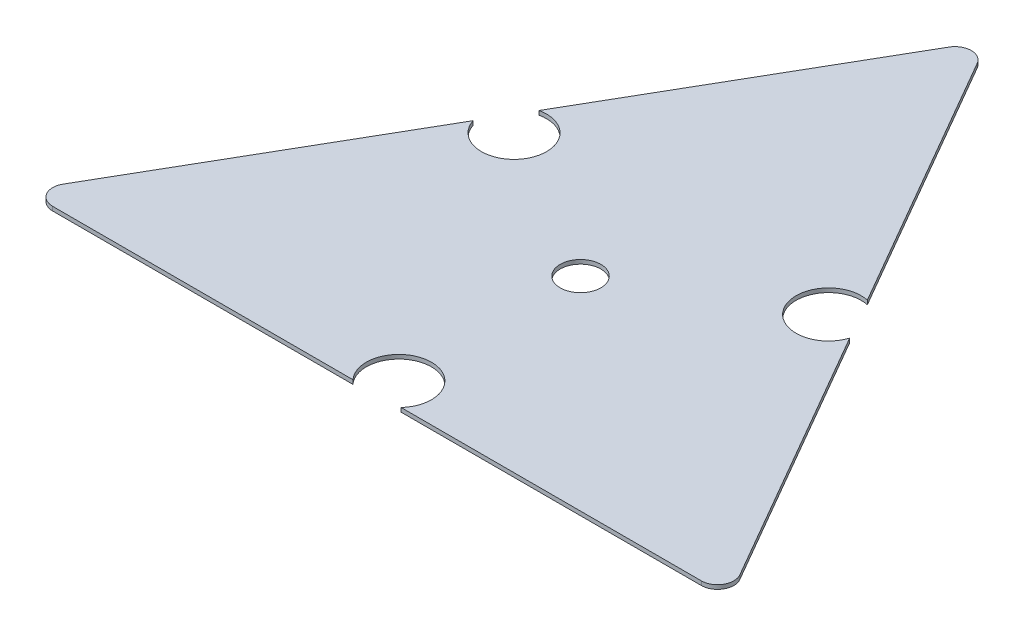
ISO-10303-21;
HEADER;
FILE_DESCRIPTION(('STEP AP214'),'2;1');
FILE_NAME('part.step','',(''),(''),'','','');
FILE_SCHEMA(('AUTOMOTIVE_DESIGN { 1 0 10303 214 1 1 1 1 }'));
ENDSEC;
DATA;
#1=APPLICATION_CONTEXT('core data for automotive mechanical design processes');
#2=APPLICATION_PROTOCOL_DEFINITION('international standard','automotive_design',2000,#1);
#3=PRODUCT_CONTEXT('',#1,'mechanical');
#4=PRODUCT('Part','Part','',(#3));
#5=PRODUCT_RELATED_PRODUCT_CATEGORY('part','',(#4));
#6=PRODUCT_DEFINITION_FORMATION('','',#4);
#7=PRODUCT_DEFINITION_CONTEXT('part definition',#1,'design');
#8=PRODUCT_DEFINITION('design','',#6,#7);
#9=PRODUCT_DEFINITION_SHAPE('','',#8);
#10=(LENGTH_UNIT() NAMED_UNIT(*) SI_UNIT(.MILLI.,.METRE.));
#11=(NAMED_UNIT(*) PLANE_ANGLE_UNIT() SI_UNIT($,.RADIAN.));
#12=(NAMED_UNIT(*) SI_UNIT($,.STERADIAN.) SOLID_ANGLE_UNIT());
#13=UNCERTAINTY_MEASURE_WITH_UNIT(LENGTH_MEASURE(1.E-05),#10,'distance_accuracy_value','');
#14=(GEOMETRIC_REPRESENTATION_CONTEXT(3) GLOBAL_UNCERTAINTY_ASSIGNED_CONTEXT((#13)) GLOBAL_UNIT_ASSIGNED_CONTEXT((#10,
#11,#12)) REPRESENTATION_CONTEXT('',''));
#15=CARTESIAN_POINT('',(0.,0.,0.));
#16=DIRECTION('',(0.,0.,1.));
#17=DIRECTION('',(1.,0.,0.));
#18=AXIS2_PLACEMENT_3D('',#15,#16,#17);
#19=CARTESIAN_POINT('',(1.59594559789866E-13,-0.5,22.3132928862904));
#20=DIRECTION('',(0.,1.,0.));
#21=DIRECTION('',(0.,0.,1.));
#22=AXIS2_PLACEMENT_3D('',#19,#20,#21);
#23=CYLINDRICAL_SURFACE('',#22,4.00000000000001);
#24=CARTESIAN_POINT('',(1.59594559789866E-13,0.,22.3132928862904));
#25=DIRECTION('',(0.,-1.,0.));
#26=DIRECTION('',(0.,0.,-1.));
#27=AXIS2_PLACEMENT_3D('',#24,#25,#26);
#28=CIRCLE('',#27,4.00000000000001);
#29=CARTESIAN_POINT('',(-2.96337727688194,0.,25.0000000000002));
#30=VERTEX_POINT('',#29);
#31=CARTESIAN_POINT('',(2.96337727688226,0.,25.0000000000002));
#32=VERTEX_POINT('',#31);
#33=EDGE_CURVE('E119',#30,#32,#28,.T.);
#34=ORIENTED_EDGE('',*,*,#33,.F.);
#35=DIRECTION('',(0.,1.,0.));
#36=VECTOR('',#35,1.);
#37=CARTESIAN_POINT('',(-2.96337727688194,-0.5,25.0000000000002));
#38=LINE('',#37,#36);
#39=CARTESIAN_POINT('',(-2.96337727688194,-0.5,25.0000000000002));
#40=VERTEX_POINT('',#39);
#41=EDGE_CURVE('E182',#40,#30,#38,.T.);
#42=ORIENTED_EDGE('',*,*,#41,.F.);
#43=CARTESIAN_POINT('',(1.59594559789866E-13,-0.5,22.3132928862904));
#44=DIRECTION('',(0.,-1.,0.));
#45=DIRECTION('',(0.,0.,-1.));
#46=AXIS2_PLACEMENT_3D('',#43,#44,#45);
#47=CIRCLE('',#46,4.00000000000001);
#48=CARTESIAN_POINT('',(2.96337727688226,-0.5,25.0000000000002));
#49=VERTEX_POINT('',#48);
#50=EDGE_CURVE('E121',#40,#49,#47,.T.);
#51=ORIENTED_EDGE('',*,*,#50,.T.);
#52=DIRECTION('',(0.,1.,0.));
#53=VECTOR('',#52,1.);
#54=CARTESIAN_POINT('',(2.96337727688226,-0.5,25.0000000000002));
#55=LINE('',#54,#53);
#56=EDGE_CURVE('E115',#49,#32,#55,.T.);
#57=ORIENTED_EDGE('',*,*,#56,.T.);
#58=EDGE_LOOP('',(#34,#42,#51,#57));
#59=FACE_BOUND('',#58,.T.);
#60=ADVANCED_FACE('F26',(#59),#23,.F.);
#61=CARTESIAN_POINT('',(-43.3012701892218,-0.5,25.0000000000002));
#62=DIRECTION('',(0.,0.,1.));
#63=DIRECTION('',(1.,0.,0.));
#64=AXIS2_PLACEMENT_3D('',#61,#62,#63);
#65=PLANE('',#64);
#66=DIRECTION('',(1.,0.,0.));
#67=VECTOR('',#66,1.);
#68=CARTESIAN_POINT('',(-43.3012701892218,0.,25.0000000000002));
#69=LINE('',#68,#67);
#70=CARTESIAN_POINT('',(-39.8371685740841,0.,25.0000000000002));
#71=VERTEX_POINT('',#70);
#72=EDGE_CURVE('E138',#71,#30,#69,.T.);
#73=ORIENTED_EDGE('',*,*,#72,.F.);
#74=DIRECTION('',(0.,1.,0.));
#75=VECTOR('',#74,1.);
#76=CARTESIAN_POINT('',(-39.8371685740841,-0.5,25.0000000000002));
#77=LINE('',#76,#75);
#78=CARTESIAN_POINT('',(-39.8371685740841,-0.5,25.0000000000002));
#79=VERTEX_POINT('',#78);
#80=EDGE_CURVE('E202',#71,#79,#77,.F.);
#81=ORIENTED_EDGE('',*,*,#80,.T.);
#82=DIRECTION('',(1.,0.,0.));
#83=VECTOR('',#82,1.);
#84=CARTESIAN_POINT('',(-43.3012701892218,-0.5,25.0000000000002));
#85=LINE('',#84,#83);
#86=EDGE_CURVE('E124',#79,#40,#85,.T.);
#87=ORIENTED_EDGE('',*,*,#86,.T.);
#88=ORIENTED_EDGE('',*,*,#41,.T.);
#89=EDGE_LOOP('',(#73,#81,#87,#88));
#90=FACE_BOUND('',#89,.T.);
#91=ADVANCED_FACE('F246',(#90),#65,.T.);
#92=CARTESIAN_POINT('',(-23.1323237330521,-0.5,-9.93363999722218));
#93=DIRECTION('',(-0.86602540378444,0.,-0.499999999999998));
#94=DIRECTION('',(-0.499999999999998,0.,0.86602540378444));
#95=AXIS2_PLACEMENT_3D('',#92,#93,#94);
#96=PLANE('',#95);
#97=DIRECTION('',(-0.499999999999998,0.,0.86602540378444));
#98=VECTOR('',#97,1.);
#99=CARTESIAN_POINT('',(-23.1323237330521,-0.5,-9.93363999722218));
#100=LINE('',#99,#98);
#101=CARTESIAN_POINT('',(-23.1323237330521,-0.5,-9.93363999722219));
#102=VERTEX_POINT('',#101);
#103=CARTESIAN_POINT('',(-41.5692193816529,-0.5,22.0000000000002));
#104=VERTEX_POINT('',#103);
#105=EDGE_CURVE('E178',#102,#104,#100,.T.);
#106=ORIENTED_EDGE('',*,*,#105,.T.);
#107=DIRECTION('',(0.,1.,0.));
#108=VECTOR('',#107,1.);
#109=CARTESIAN_POINT('',(-41.5692193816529,-0.5,22.0000000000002));
#110=LINE('',#109,#108);
#111=CARTESIAN_POINT('',(-41.5692193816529,0.,22.0000000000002));
#112=VERTEX_POINT('',#111);
#113=EDGE_CURVE('E184',#104,#112,#110,.T.);
#114=ORIENTED_EDGE('',*,*,#113,.T.);
#115=DIRECTION('',(-0.499999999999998,0.,0.86602540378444));
#116=VECTOR('',#115,1.);
#117=CARTESIAN_POINT('',(-23.1323237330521,0.,-9.93363999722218));
#118=LINE('',#117,#116);
#119=CARTESIAN_POINT('',(-23.1323237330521,0.,-9.93363999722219));
#120=VERTEX_POINT('',#119);
#121=EDGE_CURVE('E159',#120,#112,#118,.T.);
#122=ORIENTED_EDGE('',*,*,#121,.F.);
#123=DIRECTION('',(0.,1.,0.));
#124=VECTOR('',#123,1.);
#125=CARTESIAN_POINT('',(-23.1323237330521,-0.5,-9.93363999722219));
#126=LINE('',#125,#124);
#127=EDGE_CURVE('E185',#102,#120,#126,.T.);
#128=ORIENTED_EDGE('',*,*,#127,.F.);
#129=EDGE_LOOP('',(#106,#114,#122,#128));
#130=FACE_BOUND('',#129,.T.);
#131=ADVANCED_FACE('F239',(#130),#96,.T.);
#132=CARTESIAN_POINT('',(-19.3238784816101,-0.5,-11.1566464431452));
#133=DIRECTION('',(0.,1.,0.));
#134=DIRECTION('',(0.,0.,1.));
#135=AXIS2_PLACEMENT_3D('',#132,#133,#134);
#136=CYLINDRICAL_SURFACE('',#135,4.);
#137=CARTESIAN_POINT('',(-19.3238784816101,0.,-11.1566464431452));
#138=DIRECTION('',(0.,-1.,0.));
#139=DIRECTION('',(0.,0.,1.));
#140=AXIS2_PLACEMENT_3D('',#137,#138,#139);
#141=CIRCLE('',#140,4.);
#142=CARTESIAN_POINT('',(-20.1689464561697,0.,-15.0663600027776));
#143=VERTEX_POINT('',#142);
#144=EDGE_CURVE('E156',#143,#120,#141,.T.);
#145=ORIENTED_EDGE('',*,*,#144,.F.);
#146=DIRECTION('',(0.,1.,0.));
#147=VECTOR('',#146,1.);
#148=CARTESIAN_POINT('',(-20.1689464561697,-0.5,-15.0663600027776));
#149=LINE('',#148,#147);
#150=CARTESIAN_POINT('',(-20.1689464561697,-0.5,-15.0663600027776));
#151=VERTEX_POINT('',#150);
#152=EDGE_CURVE('E187',#151,#143,#149,.T.);
#153=ORIENTED_EDGE('',*,*,#152,.F.);
#154=CARTESIAN_POINT('',(-19.3238784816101,-0.5,-11.1566464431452));
#155=DIRECTION('',(0.,-1.,0.));
#156=DIRECTION('',(0.,0.,1.));
#157=AXIS2_PLACEMENT_3D('',#154,#155,#156);
#158=CIRCLE('',#157,4.);
#159=EDGE_CURVE('E175',#151,#102,#158,.T.);
#160=ORIENTED_EDGE('',*,*,#159,.T.);
#161=ORIENTED_EDGE('',*,*,#127,.T.);
#162=EDGE_LOOP('',(#145,#153,#160,#161));
#163=FACE_BOUND('',#162,.T.);
#164=ADVANCED_FACE('F236',(#163),#136,.F.);
#165=CARTESIAN_POINT('',(0.,-0.5,-50.));
#166=DIRECTION('',(-0.86602540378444,0.,-0.499999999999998));
#167=DIRECTION('',(-0.499999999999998,0.,0.86602540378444));
#168=AXIS2_PLACEMENT_3D('',#165,#166,#167);
#169=PLANE('',#168);
#170=DIRECTION('',(-0.499999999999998,0.,0.86602540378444));
#171=VECTOR('',#170,1.);
#172=CARTESIAN_POINT('',(0.,0.,-50.));
#173=LINE('',#172,#171);
#174=CARTESIAN_POINT('',(-1.73205080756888,0.,-47.));
#175=VERTEX_POINT('',#174);
#176=EDGE_CURVE('E154',#175,#143,#173,.T.);
#177=ORIENTED_EDGE('',*,*,#176,.F.);
#178=DIRECTION('',(0.,1.,0.));
#179=VECTOR('',#178,1.);
#180=CARTESIAN_POINT('',(-1.73205080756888,-0.5,-47.));
#181=LINE('',#180,#179);
#182=CARTESIAN_POINT('',(-1.73205080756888,-0.5,-47.));
#183=VERTEX_POINT('',#182);
#184=EDGE_CURVE('E11',#175,#183,#181,.F.);
#185=ORIENTED_EDGE('',*,*,#184,.T.);
#186=DIRECTION('',(-0.499999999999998,0.,0.86602540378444));
#187=VECTOR('',#186,1.);
#188=CARTESIAN_POINT('',(0.,-0.5,-50.));
#189=LINE('',#188,#187);
#190=EDGE_CURVE('E173',#183,#151,#189,.T.);
#191=ORIENTED_EDGE('',*,*,#190,.T.);
#192=ORIENTED_EDGE('',*,*,#152,.T.);
#193=EDGE_LOOP('',(#177,#185,#191,#192));
#194=FACE_BOUND('',#193,.T.);
#195=ADVANCED_FACE('F231',(#194),#169,.T.);
#196=CARTESIAN_POINT('',(0.,-0.5,-50.));
#197=DIRECTION('',(0.866025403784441,0.,-0.499999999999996));
#198=DIRECTION('',(-0.499999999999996,0.,-0.866025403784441));
#199=AXIS2_PLACEMENT_3D('',#196,#197,#198);
#200=PLANE('',#199);
#201=DIRECTION('',(-0.499999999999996,0.,-0.866025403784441));
#202=VECTOR('',#201,1.);
#203=CARTESIAN_POINT('',(0.,-0.5,-50.));
#204=LINE('',#203,#202);
#205=CARTESIAN_POINT('',(20.1689464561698,-0.5,-15.0663600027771));
#206=VERTEX_POINT('',#205);
#207=CARTESIAN_POINT('',(1.73205080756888,-0.5,-47.));
#208=VERTEX_POINT('',#207);
#209=EDGE_CURVE('E170',#206,#208,#204,.T.);
#210=ORIENTED_EDGE('',*,*,#209,.T.);
#211=DIRECTION('',(0.,1.,0.));
#212=VECTOR('',#211,1.);
#213=CARTESIAN_POINT('',(1.73205080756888,-0.5,-47.));
#214=LINE('',#213,#212);
#215=CARTESIAN_POINT('',(1.73205080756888,0.,-47.));
#216=VERTEX_POINT('',#215);
#217=EDGE_CURVE('E33',#208,#216,#214,.T.);
#218=ORIENTED_EDGE('',*,*,#217,.T.);
#219=DIRECTION('',(-0.499999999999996,0.,-0.866025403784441));
#220=VECTOR('',#219,1.);
#221=CARTESIAN_POINT('',(0.,0.,-50.));
#222=LINE('',#221,#220);
#223=CARTESIAN_POINT('',(20.1689464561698,0.,-15.0663600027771));
#224=VERTEX_POINT('',#223);
#225=EDGE_CURVE('E151',#224,#216,#222,.T.);
#226=ORIENTED_EDGE('',*,*,#225,.F.);
#227=DIRECTION('',(0.,1.,0.));
#228=VECTOR('',#227,1.);
#229=CARTESIAN_POINT('',(20.1689464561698,-0.5,-15.0663600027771));
#230=LINE('',#229,#228);
#231=EDGE_CURVE('E190',#206,#224,#230,.T.);
#232=ORIENTED_EDGE('',*,*,#231,.F.);
#233=EDGE_LOOP('',(#210,#218,#226,#232));
#234=FACE_BOUND('',#233,.T.);
#235=ADVANCED_FACE('F214',(#234),#200,.T.);
#236=CARTESIAN_POINT('',(19.3238784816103,-0.5,-11.1566464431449));
#237=DIRECTION('',(0.,1.,0.));
#238=DIRECTION('',(0.,0.,1.));
#239=AXIS2_PLACEMENT_3D('',#236,#237,#238);
#240=CYLINDRICAL_SURFACE('',#239,3.99999999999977);
#241=CARTESIAN_POINT('',(19.3238784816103,0.,-11.1566464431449));
#242=DIRECTION('',(0.,-1.,0.));
#243=DIRECTION('',(0.,0.,1.));
#244=AXIS2_PLACEMENT_3D('',#241,#242,#243);
#245=CIRCLE('',#244,3.99999999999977);
#246=CARTESIAN_POINT('',(23.132323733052,0.,-9.9336399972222));
#247=VERTEX_POINT('',#246);
#248=EDGE_CURVE('E148',#247,#224,#245,.T.);
#249=ORIENTED_EDGE('',*,*,#248,.F.);
#250=DIRECTION('',(0.,1.,0.));
#251=VECTOR('',#250,1.);
#252=CARTESIAN_POINT('',(23.132323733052,-0.5,-9.9336399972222));
#253=LINE('',#252,#251);
#254=CARTESIAN_POINT('',(23.132323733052,-0.5,-9.9336399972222));
#255=VERTEX_POINT('',#254);
#256=EDGE_CURVE('E123',#255,#247,#253,.T.);
#257=ORIENTED_EDGE('',*,*,#256,.F.);
#258=CARTESIAN_POINT('',(19.3238784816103,-0.5,-11.1566464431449));
#259=DIRECTION('',(0.,-1.,0.));
#260=DIRECTION('',(0.,0.,1.));
#261=AXIS2_PLACEMENT_3D('',#258,#259,#260);
#262=CIRCLE('',#261,3.99999999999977);
#263=EDGE_CURVE('E167',#255,#206,#262,.T.);
#264=ORIENTED_EDGE('',*,*,#263,.T.);
#265=ORIENTED_EDGE('',*,*,#231,.T.);
#266=EDGE_LOOP('',(#249,#257,#264,#265));
#267=FACE_BOUND('',#266,.T.);
#268=ADVANCED_FACE('F222',(#267),#240,.F.);
#269=CARTESIAN_POINT('',(23.132323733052,-0.5,-9.9336399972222));
#270=DIRECTION('',(0.866025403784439,0.,-0.5));
#271=DIRECTION('',(-0.5,0.,-0.866025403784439));
#272=AXIS2_PLACEMENT_3D('',#269,#270,#271);
#273=PLANE('',#272);
#274=DIRECTION('',(-0.5,0.,-0.866025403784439));
#275=VECTOR('',#274,1.);
#276=CARTESIAN_POINT('',(23.132323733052,0.,-9.9336399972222));
#277=LINE('',#276,#275);
#278=CARTESIAN_POINT('',(41.5692193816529,0.,22.0000000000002));
#279=VERTEX_POINT('',#278);
#280=EDGE_CURVE('E133',#279,#247,#277,.T.);
#281=ORIENTED_EDGE('',*,*,#280,.F.);
#282=DIRECTION('',(0.,1.,0.));
#283=VECTOR('',#282,1.);
#284=CARTESIAN_POINT('',(41.5692193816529,-0.5,22.0000000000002));
#285=LINE('',#284,#283);
#286=CARTESIAN_POINT('',(41.5692193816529,-0.5,22.0000000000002));
#287=VERTEX_POINT('',#286);
#288=EDGE_CURVE('E48',#279,#287,#285,.F.);
#289=ORIENTED_EDGE('',*,*,#288,.T.);
#290=DIRECTION('',(-0.5,0.,-0.866025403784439));
#291=VECTOR('',#290,1.);
#292=CARTESIAN_POINT('',(23.132323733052,-0.5,-9.9336399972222));
#293=LINE('',#292,#291);
#294=EDGE_CURVE('E165',#287,#255,#293,.T.);
#295=ORIENTED_EDGE('',*,*,#294,.T.);
#296=ORIENTED_EDGE('',*,*,#256,.T.);
#297=EDGE_LOOP('',(#281,#289,#295,#296));
#298=FACE_BOUND('',#297,.T.);
#299=ADVANCED_FACE('F249',(#298),#273,.T.);
#300=CARTESIAN_POINT('',(2.96337727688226,-0.5,25.0000000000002));
#301=DIRECTION('',(0.,0.,1.));
#302=DIRECTION('',(1.,0.,0.));
#303=AXIS2_PLACEMENT_3D('',#300,#301,#302);
#304=PLANE('',#303);
#305=DIRECTION('',(1.,0.,0.));
#306=VECTOR('',#305,1.);
#307=CARTESIAN_POINT('',(2.96337727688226,-0.5,25.0000000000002));
#308=LINE('',#307,#306);
#309=CARTESIAN_POINT('',(39.8371685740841,-0.5,25.0000000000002));
#310=VERTEX_POINT('',#309);
#311=EDGE_CURVE('E163',#49,#310,#308,.T.);
#312=ORIENTED_EDGE('',*,*,#311,.T.);
#313=DIRECTION('',(0.,1.,0.));
#314=VECTOR('',#313,1.);
#315=CARTESIAN_POINT('',(39.8371685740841,-0.5,25.0000000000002));
#316=LINE('',#315,#314);
#317=CARTESIAN_POINT('',(39.8371685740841,0.,25.0000000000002));
#318=VERTEX_POINT('',#317);
#319=EDGE_CURVE('E131',#310,#318,#316,.T.);
#320=ORIENTED_EDGE('',*,*,#319,.T.);
#321=DIRECTION('',(1.,0.,0.));
#322=VECTOR('',#321,1.);
#323=CARTESIAN_POINT('',(2.96337727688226,0.,25.0000000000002));
#324=LINE('',#323,#322);
#325=EDGE_CURVE('E128',#32,#318,#324,.T.);
#326=ORIENTED_EDGE('',*,*,#325,.F.);
#327=ORIENTED_EDGE('',*,*,#56,.F.);
#328=EDGE_LOOP('',(#312,#320,#326,#327));
#329=FACE_BOUND('',#328,.T.);
#330=ADVANCED_FACE('F129',(#329),#304,.T.);
#331=CARTESIAN_POINT('',(1.59594559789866E-13,-0.5,22.3132928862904));
#332=DIRECTION('',(0.,-1.,0.));
#333=DIRECTION('',(0.,0.,-1.));
#334=AXIS2_PLACEMENT_3D('',#331,#332,#333);
#335=PLANE('',#334);
#336=CARTESIAN_POINT('',(0.,-0.5,0.));
#337=DIRECTION('',(0.,1.,0.));
#338=DIRECTION('',(0.,0.,1.));
#339=AXIS2_PLACEMENT_3D('',#336,#337,#338);
#340=CIRCLE('',#339,2.5);
#341=CARTESIAN_POINT('',(0.,-0.5,2.5));
#342=VERTEX_POINT('',#341);
#343=EDGE_CURVE('E140',#342,#342,#340,.T.);
#344=ORIENTED_EDGE('',*,*,#343,.T.);
#345=EDGE_LOOP('',(#344));
#346=FACE_BOUND('',#345,.T.);
#347=ORIENTED_EDGE('',*,*,#86,.F.);
#348=CARTESIAN_POINT('',(-39.8371685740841,-0.5,23.0000000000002));
#349=DIRECTION('',(0.,-1.,0.));
#350=DIRECTION('',(0.,0.,-1.));
#351=AXIS2_PLACEMENT_3D('',#348,#349,#350);
#352=CIRCLE('',#351,2.);
#353=EDGE_CURVE('E207',#79,#104,#352,.T.);
#354=ORIENTED_EDGE('',*,*,#353,.T.);
#355=ORIENTED_EDGE('',*,*,#105,.F.);
#356=ORIENTED_EDGE('',*,*,#159,.F.);
#357=ORIENTED_EDGE('',*,*,#190,.F.);
#358=CARTESIAN_POINT('',(0.,-0.5,-46.));
#359=DIRECTION('',(0.,-1.,0.));
#360=DIRECTION('',(0.,0.,-1.));
#361=AXIS2_PLACEMENT_3D('',#358,#359,#360);
#362=CIRCLE('',#361,2.);
#363=EDGE_CURVE('E204',#183,#208,#362,.T.);
#364=ORIENTED_EDGE('',*,*,#363,.T.);
#365=ORIENTED_EDGE('',*,*,#209,.F.);
#366=ORIENTED_EDGE('',*,*,#263,.F.);
#367=ORIENTED_EDGE('',*,*,#294,.F.);
#368=CARTESIAN_POINT('',(39.8371685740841,-0.5,23.0000000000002));
#369=DIRECTION('',(0.,-1.,0.));
#370=DIRECTION('',(0.,0.,-1.));
#371=AXIS2_PLACEMENT_3D('',#368,#369,#370);
#372=CIRCLE('',#371,2.);
#373=EDGE_CURVE('E40',#287,#310,#372,.T.);
#374=ORIENTED_EDGE('',*,*,#373,.T.);
#375=ORIENTED_EDGE('',*,*,#311,.F.);
#376=ORIENTED_EDGE('',*,*,#50,.F.);
#377=EDGE_LOOP('',(#347,#354,#355,#356,#357,#364,#365,#366,#367,#374,#375,#376));
#378=FACE_BOUND('',#377,.T.);
#379=ADVANCED_FACE('F225',(#346,#378),#335,.T.);
#380=CARTESIAN_POINT('',(1.59594559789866E-13,0.,22.3132928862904));
#381=DIRECTION('',(0.,-1.,0.));
#382=DIRECTION('',(0.,0.,-1.));
#383=AXIS2_PLACEMENT_3D('',#380,#381,#382);
#384=PLANE('',#383);
#385=CARTESIAN_POINT('',(0.,0.,0.));
#386=DIRECTION('',(0.,1.,0.));
#387=DIRECTION('',(0.,0.,1.));
#388=AXIS2_PLACEMENT_3D('',#385,#386,#387);
#389=CIRCLE('',#388,2.5);
#390=CARTESIAN_POINT('',(0.,0.,2.5));
#391=VERTEX_POINT('',#390);
#392=EDGE_CURVE('E143',#391,#391,#389,.T.);
#393=ORIENTED_EDGE('',*,*,#392,.F.);
#394=EDGE_LOOP('',(#393));
#395=FACE_BOUND('',#394,.T.);
#396=ORIENTED_EDGE('',*,*,#121,.T.);
#397=CARTESIAN_POINT('',(-39.8371685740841,0.,23.0000000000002));
#398=DIRECTION('',(0.,-1.,0.));
#399=DIRECTION('',(0.,0.,-1.));
#400=AXIS2_PLACEMENT_3D('',#397,#398,#399);
#401=CIRCLE('',#400,2.);
#402=EDGE_CURVE('E200',#112,#71,#401,.F.);
#403=ORIENTED_EDGE('',*,*,#402,.T.);
#404=ORIENTED_EDGE('',*,*,#72,.T.);
#405=ORIENTED_EDGE('',*,*,#33,.T.);
#406=ORIENTED_EDGE('',*,*,#325,.T.);
#407=CARTESIAN_POINT('',(39.8371685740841,0.,23.0000000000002));
#408=DIRECTION('',(0.,-1.,0.));
#409=DIRECTION('',(0.,0.,-1.));
#410=AXIS2_PLACEMENT_3D('',#407,#408,#409);
#411=CIRCLE('',#410,2.);
#412=EDGE_CURVE('E198',#318,#279,#411,.F.);
#413=ORIENTED_EDGE('',*,*,#412,.T.);
#414=ORIENTED_EDGE('',*,*,#280,.T.);
#415=ORIENTED_EDGE('',*,*,#248,.T.);
#416=ORIENTED_EDGE('',*,*,#225,.T.);
#417=CARTESIAN_POINT('',(0.,0.,-46.));
#418=DIRECTION('',(0.,-1.,0.));
#419=DIRECTION('',(0.,0.,-1.));
#420=AXIS2_PLACEMENT_3D('',#417,#418,#419);
#421=CIRCLE('',#420,2.);
#422=EDGE_CURVE('E196',#216,#175,#421,.F.);
#423=ORIENTED_EDGE('',*,*,#422,.T.);
#424=ORIENTED_EDGE('',*,*,#176,.T.);
#425=ORIENTED_EDGE('',*,*,#144,.T.);
#426=EDGE_LOOP('',(#396,#403,#404,#405,#406,#413,#414,#415,#416,#423,#424,#425));
#427=FACE_BOUND('',#426,.T.);
#428=ADVANCED_FACE('F136',(#395,#427),#384,.F.);
#429=CARTESIAN_POINT('',(0.,-0.5,0.));
#430=DIRECTION('',(0.,1.,0.));
#431=DIRECTION('',(0.,0.,1.));
#432=AXIS2_PLACEMENT_3D('',#429,#430,#431);
#433=CYLINDRICAL_SURFACE('',#432,2.5);
#434=ORIENTED_EDGE('',*,*,#343,.F.);
#435=EDGE_LOOP('',(#434));
#436=FACE_BOUND('',#435,.T.);
#437=ORIENTED_EDGE('',*,*,#392,.T.);
#438=EDGE_LOOP('',(#437));
#439=FACE_BOUND('',#438,.T.);
#440=ADVANCED_FACE('F297',(#436,#439),#433,.F.);
#441=CARTESIAN_POINT('',(-39.8371685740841,-0.5,23.0000000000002));
#442=DIRECTION('',(0.,1.,0.));
#443=DIRECTION('',(0.,0.,1.));
#444=AXIS2_PLACEMENT_3D('',#441,#442,#443);
#445=CYLINDRICAL_SURFACE('',#444,2.);
#446=ORIENTED_EDGE('',*,*,#353,.F.);
#447=ORIENTED_EDGE('',*,*,#80,.F.);
#448=ORIENTED_EDGE('',*,*,#402,.F.);
#449=ORIENTED_EDGE('',*,*,#113,.F.);
#450=EDGE_LOOP('',(#446,#447,#448,#449));
#451=FACE_BOUND('',#450,.T.);
#452=ADVANCED_FACE('F243',(#451),#445,.T.);
#453=CARTESIAN_POINT('',(39.8371685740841,-0.5,23.0000000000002));
#454=DIRECTION('',(0.,1.,0.));
#455=DIRECTION('',(0.,0.,1.));
#456=AXIS2_PLACEMENT_3D('',#453,#454,#455);
#457=CYLINDRICAL_SURFACE('',#456,2.);
#458=ORIENTED_EDGE('',*,*,#373,.F.);
#459=ORIENTED_EDGE('',*,*,#288,.F.);
#460=ORIENTED_EDGE('',*,*,#412,.F.);
#461=ORIENTED_EDGE('',*,*,#319,.F.);
#462=EDGE_LOOP('',(#458,#459,#460,#461));
#463=FACE_BOUND('',#462,.T.);
#464=ADVANCED_FACE('F248',(#463),#457,.T.);
#465=CARTESIAN_POINT('',(0.,-0.5,-46.));
#466=DIRECTION('',(0.,1.,0.));
#467=DIRECTION('',(0.,0.,1.));
#468=AXIS2_PLACEMENT_3D('',#465,#466,#467);
#469=CYLINDRICAL_SURFACE('',#468,2.);
#470=ORIENTED_EDGE('',*,*,#363,.F.);
#471=ORIENTED_EDGE('',*,*,#184,.F.);
#472=ORIENTED_EDGE('',*,*,#422,.F.);
#473=ORIENTED_EDGE('',*,*,#217,.F.);
#474=EDGE_LOOP('',(#470,#471,#472,#473));
#475=FACE_BOUND('',#474,.T.);
#476=ADVANCED_FACE('F229',(#475),#469,.T.);
#477=CLOSED_SHELL('',(#60,#91,#131,#164,#195,#235,#268,#299,#330,#379,#428,#440,#452,#464,#476));
#478=MANIFOLD_SOLID_BREP('B2',#477);
#479=ADVANCED_BREP_SHAPE_REPRESENTATION('',(#18,#478),#14);
#480=SHAPE_DEFINITION_REPRESENTATION(#9,#479);
ENDSEC;
END-ISO-10303-21;
